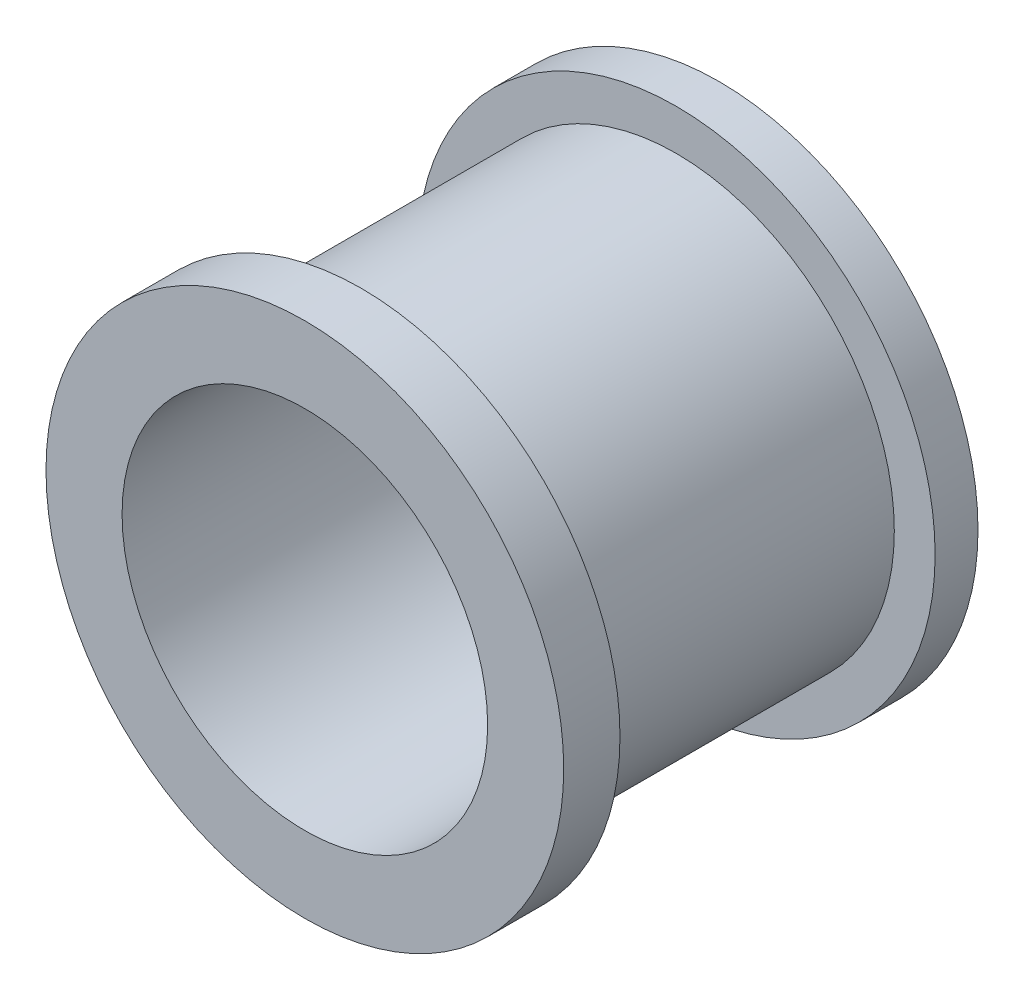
from build123d import *

# Parameters (mm, degrees)
SKETCH3_R          = 6.49605
CUT_EXTRUDE1_DEPTH = 13
SKETCH4_R          = 5
CUT_EXTRUDE2_DEPTH = 19.392389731


with BuildPart() as part:
    # Sketch2 → Revolve1 (revolve)
    with BuildSketch(Plane(origin=(0, 0, 0), x_dir=(1, 0, 0), z_dir=(0, 1, 0)), mode=Mode.PRIVATE) as revolve1_sk:
        Polygon((0, 0), (0, 14.724), (9.2, 14.724), (9.2, 13.2), (7.75, 13.2), (7.75, 2), (9.2, 2), (9.2, 0), align=None)
    revolve(revolve1_sk.sketch.rotate(Axis((0, 0, 0), (0, 0, 1)), 180), axis=Axis((0, 0, 0), (0, 0, 1)))

    # Sketch3 → Cut-Extrude1 (cut)
    with BuildSketch(Plane.XY):
        Circle(SKETCH3_R)
    extrude(amount=-CUT_EXTRUDE1_DEPTH, mode=Mode.SUBTRACT)

    # Sketch4 → Cut-Extrude2 (cut, through all)
    with BuildSketch(Plane(origin=(0, 0, -13), x_dir=(-1, 0, 0), z_dir=(0, 0, -1))):
        Circle(SKETCH4_R)
    extrude(amount=CUT_EXTRUDE2_DEPTH, mode=Mode.SUBTRACT)


solid = part.part
